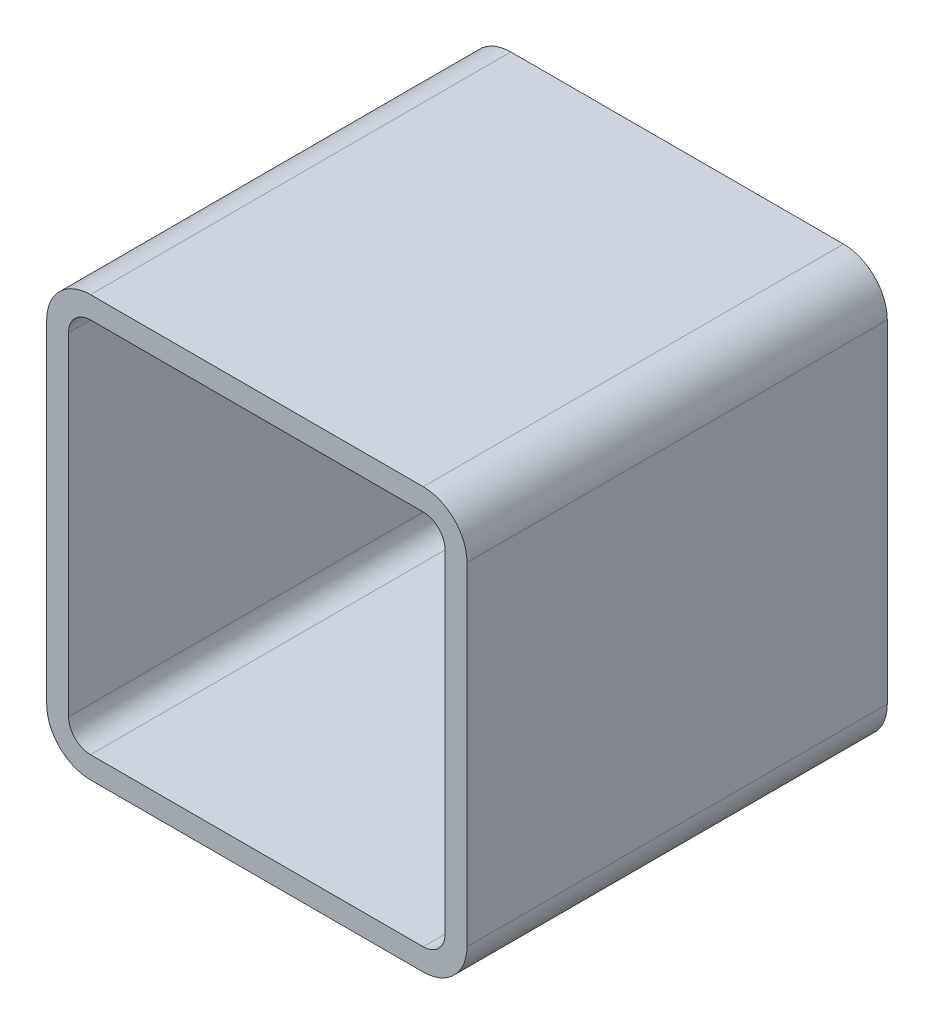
ISO-10303-21;
HEADER;
FILE_DESCRIPTION(('STEP AP214'),'2;1');
FILE_NAME('part.step','',(''),(''),'','','');
FILE_SCHEMA(('AUTOMOTIVE_DESIGN { 1 0 10303 214 1 1 1 1 }'));
ENDSEC;
DATA;
#1=APPLICATION_CONTEXT('core data for automotive mechanical design processes');
#2=APPLICATION_PROTOCOL_DEFINITION('international standard','automotive_design',2000,#1);
#3=PRODUCT_CONTEXT('',#1,'mechanical');
#4=PRODUCT('Part','Part','',(#3));
#5=PRODUCT_RELATED_PRODUCT_CATEGORY('part','',(#4));
#6=PRODUCT_DEFINITION_FORMATION('','',#4);
#7=PRODUCT_DEFINITION_CONTEXT('part definition',#1,'design');
#8=PRODUCT_DEFINITION('design','',#6,#7);
#9=PRODUCT_DEFINITION_SHAPE('','',#8);
#10=(LENGTH_UNIT() NAMED_UNIT(*) SI_UNIT(.MILLI.,.METRE.));
#11=(NAMED_UNIT(*) PLANE_ANGLE_UNIT() SI_UNIT($,.RADIAN.));
#12=(NAMED_UNIT(*) SI_UNIT($,.STERADIAN.) SOLID_ANGLE_UNIT());
#13=UNCERTAINTY_MEASURE_WITH_UNIT(LENGTH_MEASURE(1.E-05),#10,'distance_accuracy_value','');
#14=(GEOMETRIC_REPRESENTATION_CONTEXT(3) GLOBAL_UNCERTAINTY_ASSIGNED_CONTEXT((#13)) GLOBAL_UNIT_ASSIGNED_CONTEXT((#10,
#11,#12)) REPRESENTATION_CONTEXT('',''));
#15=CARTESIAN_POINT('',(0.,0.,0.));
#16=DIRECTION('',(0.,0.,1.));
#17=DIRECTION('',(1.,0.,0.));
#18=AXIS2_PLACEMENT_3D('',#15,#16,#17);
#19=CARTESIAN_POINT('',(32.8567030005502,274.924496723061,304.8));
#20=DIRECTION('',(0.,0.,1.));
#21=DIRECTION('',(1.,0.,0.));
#22=AXIS2_PLACEMENT_3D('',#19,#20,#21);
#23=PLANE('',#22);
#24=CARTESIAN_POINT('',(32.8567030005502,274.924496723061,304.8));
#25=DIRECTION('',(0.,0.,1.));
#26=DIRECTION('',(1.,0.,0.));
#27=AXIS2_PLACEMENT_3D('',#24,#25,#26);
#28=CIRCLE('',#27,31.75);
#29=CARTESIAN_POINT('',(32.8567030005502,306.674496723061,304.8));
#30=VERTEX_POINT('',#29);
#31=CARTESIAN_POINT('',(1.10670300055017,274.924496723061,304.8));
#32=VERTEX_POINT('',#31);
#33=EDGE_CURVE('E211',#30,#32,#28,.T.);
#34=ORIENTED_EDGE('',*,*,#33,.T.);
#35=DIRECTION('',(0.,-1.,0.));
#36=VECTOR('',#35,1.);
#37=CARTESIAN_POINT('',(1.10670300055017,33.6244967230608,304.8));
#38=LINE('',#37,#36);
#39=CARTESIAN_POINT('',(1.10670300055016,33.6244967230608,304.8));
#40=VERTEX_POINT('',#39);
#41=EDGE_CURVE('E214',#32,#40,#38,.T.);
#42=ORIENTED_EDGE('',*,*,#41,.T.);
#43=CARTESIAN_POINT('',(32.8567030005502,33.6244967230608,304.8));
#44=DIRECTION('',(0.,0.,1.));
#45=DIRECTION('',(1.,0.,0.));
#46=AXIS2_PLACEMENT_3D('',#43,#44,#45);
#47=CIRCLE('',#46,31.75);
#48=CARTESIAN_POINT('',(32.8567030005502,1.87449672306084,304.8));
#49=VERTEX_POINT('',#48);
#50=EDGE_CURVE('E217',#40,#49,#47,.T.);
#51=ORIENTED_EDGE('',*,*,#50,.T.);
#52=DIRECTION('',(1.,0.,0.));
#53=VECTOR('',#52,1.);
#54=CARTESIAN_POINT('',(274.15670300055,1.87449672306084,304.8));
#55=LINE('',#54,#53);
#56=CARTESIAN_POINT('',(274.15670300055,1.87449672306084,304.8));
#57=VERTEX_POINT('',#56);
#58=EDGE_CURVE('E219',#49,#57,#55,.T.);
#59=ORIENTED_EDGE('',*,*,#58,.T.);
#60=CARTESIAN_POINT('',(274.15670300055,33.6244967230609,304.8));
#61=DIRECTION('',(0.,0.,1.));
#62=DIRECTION('',(1.,0.,0.));
#63=AXIS2_PLACEMENT_3D('',#60,#61,#62);
#64=CIRCLE('',#63,31.75);
#65=CARTESIAN_POINT('',(305.90670300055,33.6244967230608,304.8));
#66=VERTEX_POINT('',#65);
#67=EDGE_CURVE('E221',#57,#66,#64,.T.);
#68=ORIENTED_EDGE('',*,*,#67,.T.);
#69=DIRECTION('',(0.,1.,0.));
#70=VECTOR('',#69,1.);
#71=CARTESIAN_POINT('',(305.90670300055,274.924496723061,304.8));
#72=LINE('',#71,#70);
#73=CARTESIAN_POINT('',(305.90670300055,274.924496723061,304.8));
#74=VERTEX_POINT('',#73);
#75=EDGE_CURVE('E223',#66,#74,#72,.T.);
#76=ORIENTED_EDGE('',*,*,#75,.T.);
#77=CARTESIAN_POINT('',(274.15670300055,274.924496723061,304.8));
#78=DIRECTION('',(0.,0.,1.));
#79=DIRECTION('',(1.,0.,0.));
#80=AXIS2_PLACEMENT_3D('',#77,#78,#79);
#81=CIRCLE('',#80,31.75);
#82=CARTESIAN_POINT('',(274.15670300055,306.674496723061,304.8));
#83=VERTEX_POINT('',#82);
#84=EDGE_CURVE('E225',#74,#83,#81,.T.);
#85=ORIENTED_EDGE('',*,*,#84,.T.);
#86=DIRECTION('',(-1.,0.,0.));
#87=VECTOR('',#86,1.);
#88=CARTESIAN_POINT('',(32.8567030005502,306.674496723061,304.8));
#89=LINE('',#88,#87);
#90=EDGE_CURVE('E227',#83,#30,#89,.T.);
#91=ORIENTED_EDGE('',*,*,#90,.T.);
#92=EDGE_LOOP('',(#34,#42,#51,#59,#68,#76,#85,#91));
#93=FACE_BOUND('',#92,.T.);
#94=DIRECTION('',(0.,-1.,0.));
#95=VECTOR('',#94,1.);
#96=CARTESIAN_POINT('',(16.9817030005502,33.6244967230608,304.8));
#97=LINE('',#96,#95);
#98=CARTESIAN_POINT('',(16.9817030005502,274.924496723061,304.8));
#99=VERTEX_POINT('',#98);
#100=CARTESIAN_POINT('',(16.9817030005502,33.6244967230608,304.8));
#101=VERTEX_POINT('',#100);
#102=EDGE_CURVE('E154',#99,#101,#97,.T.);
#103=ORIENTED_EDGE('',*,*,#102,.F.);
#104=CARTESIAN_POINT('',(32.8567030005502,274.924496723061,304.8));
#105=DIRECTION('',(0.,0.,1.));
#106=DIRECTION('',(1.,0.,0.));
#107=AXIS2_PLACEMENT_3D('',#104,#105,#106);
#108=CIRCLE('',#107,15.875);
#109=CARTESIAN_POINT('',(32.8567030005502,290.799496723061,304.8));
#110=VERTEX_POINT('',#109);
#111=EDGE_CURVE('E146',#110,#99,#108,.T.);
#112=ORIENTED_EDGE('',*,*,#111,.F.);
#113=DIRECTION('',(-1.,0.,0.));
#114=VECTOR('',#113,1.);
#115=CARTESIAN_POINT('',(32.8567030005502,290.799496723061,304.8));
#116=LINE('',#115,#114);
#117=CARTESIAN_POINT('',(274.15670300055,290.799496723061,304.8));
#118=VERTEX_POINT('',#117);
#119=EDGE_CURVE('E179',#118,#110,#116,.T.);
#120=ORIENTED_EDGE('',*,*,#119,.F.);
#121=CARTESIAN_POINT('',(274.15670300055,274.924496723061,304.8));
#122=DIRECTION('',(0.,0.,1.));
#123=DIRECTION('',(1.,0.,0.));
#124=AXIS2_PLACEMENT_3D('',#121,#122,#123);
#125=CIRCLE('',#124,15.875);
#126=CARTESIAN_POINT('',(290.03170300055,274.924496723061,304.8));
#127=VERTEX_POINT('',#126);
#128=EDGE_CURVE('E177',#127,#118,#125,.T.);
#129=ORIENTED_EDGE('',*,*,#128,.F.);
#130=DIRECTION('',(0.,1.,0.));
#131=VECTOR('',#130,1.);
#132=CARTESIAN_POINT('',(290.03170300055,274.924496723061,304.8));
#133=LINE('',#132,#131);
#134=CARTESIAN_POINT('',(290.03170300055,33.6244967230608,304.8));
#135=VERTEX_POINT('',#134);
#136=EDGE_CURVE('E175',#135,#127,#133,.T.);
#137=ORIENTED_EDGE('',*,*,#136,.F.);
#138=CARTESIAN_POINT('',(274.15670300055,33.6244967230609,304.8));
#139=DIRECTION('',(0.,0.,1.));
#140=DIRECTION('',(1.,0.,0.));
#141=AXIS2_PLACEMENT_3D('',#138,#139,#140);
#142=CIRCLE('',#141,15.875);
#143=CARTESIAN_POINT('',(274.15670300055,17.7494967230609,304.8));
#144=VERTEX_POINT('',#143);
#145=EDGE_CURVE('E173',#144,#135,#142,.T.);
#146=ORIENTED_EDGE('',*,*,#145,.F.);
#147=DIRECTION('',(1.,0.,0.));
#148=VECTOR('',#147,1.);
#149=CARTESIAN_POINT('',(274.15670300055,17.7494967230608,304.8));
#150=LINE('',#149,#148);
#151=CARTESIAN_POINT('',(32.8567030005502,17.7494967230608,304.8));
#152=VERTEX_POINT('',#151);
#153=EDGE_CURVE('E169',#152,#144,#150,.T.);
#154=ORIENTED_EDGE('',*,*,#153,.F.);
#155=CARTESIAN_POINT('',(32.8567030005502,33.6244967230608,304.8));
#156=DIRECTION('',(0.,0.,1.));
#157=DIRECTION('',(1.,0.,0.));
#158=AXIS2_PLACEMENT_3D('',#155,#156,#157);
#159=CIRCLE('',#158,15.875);
#160=EDGE_CURVE('E167',#101,#152,#159,.T.);
#161=ORIENTED_EDGE('',*,*,#160,.F.);
#162=EDGE_LOOP('',(#103,#112,#120,#129,#137,#146,#154,#161));
#163=FACE_BOUND('',#162,.T.);
#164=ADVANCED_FACE('F33',(#93,#163),#23,.T.);
#165=CARTESIAN_POINT('',(32.8567030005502,274.924496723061,0.));
#166=DIRECTION('',(0.,0.,1.));
#167=DIRECTION('',(1.,0.,0.));
#168=AXIS2_PLACEMENT_3D('',#165,#166,#167);
#169=PLANE('',#168);
#170=CARTESIAN_POINT('',(32.8567030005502,274.924496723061,0.));
#171=DIRECTION('',(0.,0.,1.));
#172=DIRECTION('',(1.,0.,0.));
#173=AXIS2_PLACEMENT_3D('',#170,#171,#172);
#174=CIRCLE('',#173,31.75);
#175=CARTESIAN_POINT('',(32.8567030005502,306.674496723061,0.));
#176=VERTEX_POINT('',#175);
#177=CARTESIAN_POINT('',(1.10670300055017,274.924496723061,0.));
#178=VERTEX_POINT('',#177);
#179=EDGE_CURVE('E162',#176,#178,#174,.T.);
#180=ORIENTED_EDGE('',*,*,#179,.F.);
#181=DIRECTION('',(-1.,0.,0.));
#182=VECTOR('',#181,1.);
#183=CARTESIAN_POINT('',(32.8567030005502,306.674496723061,0.));
#184=LINE('',#183,#182);
#185=CARTESIAN_POINT('',(274.15670300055,306.674496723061,0.));
#186=VERTEX_POINT('',#185);
#187=EDGE_CURVE('E215',#186,#176,#184,.T.);
#188=ORIENTED_EDGE('',*,*,#187,.F.);
#189=CARTESIAN_POINT('',(274.15670300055,274.924496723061,0.));
#190=DIRECTION('',(0.,0.,1.));
#191=DIRECTION('',(1.,0.,0.));
#192=AXIS2_PLACEMENT_3D('',#189,#190,#191);
#193=CIRCLE('',#192,31.75);
#194=CARTESIAN_POINT('',(305.90670300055,274.924496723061,0.));
#195=VERTEX_POINT('',#194);
#196=EDGE_CURVE('E242',#195,#186,#193,.T.);
#197=ORIENTED_EDGE('',*,*,#196,.F.);
#198=DIRECTION('',(0.,1.,0.));
#199=VECTOR('',#198,1.);
#200=CARTESIAN_POINT('',(305.90670300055,274.924496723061,0.));
#201=LINE('',#200,#199);
#202=CARTESIAN_POINT('',(305.90670300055,33.6244967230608,0.));
#203=VERTEX_POINT('',#202);
#204=EDGE_CURVE('E240',#203,#195,#201,.T.);
#205=ORIENTED_EDGE('',*,*,#204,.F.);
#206=CARTESIAN_POINT('',(274.15670300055,33.6244967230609,0.));
#207=DIRECTION('',(0.,0.,1.));
#208=DIRECTION('',(1.,0.,0.));
#209=AXIS2_PLACEMENT_3D('',#206,#207,#208);
#210=CIRCLE('',#209,31.75);
#211=CARTESIAN_POINT('',(274.15670300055,1.87449672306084,0.));
#212=VERTEX_POINT('',#211);
#213=EDGE_CURVE('E238',#212,#203,#210,.T.);
#214=ORIENTED_EDGE('',*,*,#213,.F.);
#215=DIRECTION('',(1.,0.,0.));
#216=VECTOR('',#215,1.);
#217=CARTESIAN_POINT('',(274.15670300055,1.87449672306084,0.));
#218=LINE('',#217,#216);
#219=CARTESIAN_POINT('',(32.8567030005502,1.87449672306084,0.));
#220=VERTEX_POINT('',#219);
#221=EDGE_CURVE('E236',#220,#212,#218,.T.);
#222=ORIENTED_EDGE('',*,*,#221,.F.);
#223=CARTESIAN_POINT('',(32.8567030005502,33.6244967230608,0.));
#224=DIRECTION('',(0.,0.,1.));
#225=DIRECTION('',(1.,0.,0.));
#226=AXIS2_PLACEMENT_3D('',#223,#224,#225);
#227=CIRCLE('',#226,31.75);
#228=CARTESIAN_POINT('',(1.10670300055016,33.6244967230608,0.));
#229=VERTEX_POINT('',#228);
#230=EDGE_CURVE('E234',#229,#220,#227,.T.);
#231=ORIENTED_EDGE('',*,*,#230,.F.);
#232=DIRECTION('',(0.,-1.,0.));
#233=VECTOR('',#232,1.);
#234=CARTESIAN_POINT('',(1.10670300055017,33.6244967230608,0.));
#235=LINE('',#234,#233);
#236=EDGE_CURVE('E232',#178,#229,#235,.T.);
#237=ORIENTED_EDGE('',*,*,#236,.F.);
#238=EDGE_LOOP('',(#180,#188,#197,#205,#214,#222,#231,#237));
#239=FACE_BOUND('',#238,.T.);
#240=CARTESIAN_POINT('',(32.8567030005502,274.924496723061,0.));
#241=DIRECTION('',(0.,0.,1.));
#242=DIRECTION('',(1.,0.,0.));
#243=AXIS2_PLACEMENT_3D('',#240,#241,#242);
#244=CIRCLE('',#243,15.875);
#245=CARTESIAN_POINT('',(32.8567030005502,290.799496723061,0.));
#246=VERTEX_POINT('',#245);
#247=CARTESIAN_POINT('',(16.9817030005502,274.924496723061,0.));
#248=VERTEX_POINT('',#247);
#249=EDGE_CURVE('E56',#246,#248,#244,.T.);
#250=ORIENTED_EDGE('',*,*,#249,.T.);
#251=DIRECTION('',(0.,-1.,0.));
#252=VECTOR('',#251,1.);
#253=CARTESIAN_POINT('',(16.9817030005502,33.6244967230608,0.));
#254=LINE('',#253,#252);
#255=CARTESIAN_POINT('',(16.9817030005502,33.6244967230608,0.));
#256=VERTEX_POINT('',#255);
#257=EDGE_CURVE('E161',#248,#256,#254,.T.);
#258=ORIENTED_EDGE('',*,*,#257,.T.);
#259=CARTESIAN_POINT('',(32.8567030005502,33.6244967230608,0.));
#260=DIRECTION('',(0.,0.,1.));
#261=DIRECTION('',(1.,0.,0.));
#262=AXIS2_PLACEMENT_3D('',#259,#260,#261);
#263=CIRCLE('',#262,15.875);
#264=CARTESIAN_POINT('',(32.8567030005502,17.7494967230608,0.));
#265=VERTEX_POINT('',#264);
#266=EDGE_CURVE('E183',#256,#265,#263,.T.);
#267=ORIENTED_EDGE('',*,*,#266,.T.);
#268=DIRECTION('',(1.,0.,0.));
#269=VECTOR('',#268,1.);
#270=CARTESIAN_POINT('',(274.15670300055,17.7494967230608,0.));
#271=LINE('',#270,#269);
#272=CARTESIAN_POINT('',(274.15670300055,17.7494967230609,0.));
#273=VERTEX_POINT('',#272);
#274=EDGE_CURVE('E186',#265,#273,#271,.T.);
#275=ORIENTED_EDGE('',*,*,#274,.T.);
#276=CARTESIAN_POINT('',(274.15670300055,33.6244967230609,0.));
#277=DIRECTION('',(0.,0.,1.));
#278=DIRECTION('',(1.,0.,0.));
#279=AXIS2_PLACEMENT_3D('',#276,#277,#278);
#280=CIRCLE('',#279,15.875);
#281=CARTESIAN_POINT('',(290.03170300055,33.6244967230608,0.));
#282=VERTEX_POINT('',#281);
#283=EDGE_CURVE('E189',#273,#282,#280,.T.);
#284=ORIENTED_EDGE('',*,*,#283,.T.);
#285=DIRECTION('',(0.,1.,0.));
#286=VECTOR('',#285,1.);
#287=CARTESIAN_POINT('',(290.03170300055,274.924496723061,0.));
#288=LINE('',#287,#286);
#289=CARTESIAN_POINT('',(290.03170300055,274.924496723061,0.));
#290=VERTEX_POINT('',#289);
#291=EDGE_CURVE('E192',#282,#290,#288,.T.);
#292=ORIENTED_EDGE('',*,*,#291,.T.);
#293=CARTESIAN_POINT('',(274.15670300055,274.924496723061,0.));
#294=DIRECTION('',(0.,0.,1.));
#295=DIRECTION('',(1.,0.,0.));
#296=AXIS2_PLACEMENT_3D('',#293,#294,#295);
#297=CIRCLE('',#296,15.875);
#298=CARTESIAN_POINT('',(274.15670300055,290.799496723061,0.));
#299=VERTEX_POINT('',#298);
#300=EDGE_CURVE('E195',#290,#299,#297,.T.);
#301=ORIENTED_EDGE('',*,*,#300,.T.);
#302=DIRECTION('',(-1.,0.,0.));
#303=VECTOR('',#302,1.);
#304=CARTESIAN_POINT('',(32.8567030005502,290.799496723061,0.));
#305=LINE('',#304,#303);
#306=EDGE_CURVE('E155',#299,#246,#305,.T.);
#307=ORIENTED_EDGE('',*,*,#306,.T.);
#308=EDGE_LOOP('',(#250,#258,#267,#275,#284,#292,#301,#307));
#309=FACE_BOUND('',#308,.T.);
#310=ADVANCED_FACE('F272',(#239,#309),#169,.F.);
#311=CARTESIAN_POINT('',(32.8567030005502,274.924496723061,304.8));
#312=DIRECTION('',(0.,0.,-1.));
#313=DIRECTION('',(-1.,0.,0.));
#314=AXIS2_PLACEMENT_3D('',#311,#312,#313);
#315=CYLINDRICAL_SURFACE('',#314,31.75);
#316=ORIENTED_EDGE('',*,*,#179,.T.);
#317=DIRECTION('',(0.,0.,-1.));
#318=VECTOR('',#317,1.);
#319=CARTESIAN_POINT('',(1.10670300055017,274.924496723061,304.8));
#320=LINE('',#319,#318);
#321=EDGE_CURVE('E11',#32,#178,#320,.T.);
#322=ORIENTED_EDGE('',*,*,#321,.F.);
#323=ORIENTED_EDGE('',*,*,#33,.F.);
#324=DIRECTION('',(0.,0.,-1.));
#325=VECTOR('',#324,1.);
#326=CARTESIAN_POINT('',(32.8567030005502,306.674496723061,304.8));
#327=LINE('',#326,#325);
#328=EDGE_CURVE('E229',#30,#176,#327,.T.);
#329=ORIENTED_EDGE('',*,*,#328,.T.);
#330=EDGE_LOOP('',(#316,#322,#323,#329));
#331=FACE_BOUND('',#330,.T.);
#332=ADVANCED_FACE('F35',(#331),#315,.T.);
#333=CARTESIAN_POINT('',(1.10670300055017,33.6244967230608,304.8));
#334=DIRECTION('',(1.,0.,0.));
#335=DIRECTION('',(0.,0.,-1.));
#336=AXIS2_PLACEMENT_3D('',#333,#334,#335);
#337=PLANE('',#336);
#338=ORIENTED_EDGE('',*,*,#236,.T.);
#339=DIRECTION('',(0.,0.,-1.));
#340=VECTOR('',#339,1.);
#341=CARTESIAN_POINT('',(1.10670300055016,33.6244967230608,304.8));
#342=LINE('',#341,#340);
#343=EDGE_CURVE('E41',#40,#229,#342,.T.);
#344=ORIENTED_EDGE('',*,*,#343,.F.);
#345=ORIENTED_EDGE('',*,*,#41,.F.);
#346=ORIENTED_EDGE('',*,*,#321,.T.);
#347=EDGE_LOOP('',(#338,#344,#345,#346));
#348=FACE_BOUND('',#347,.T.);
#349=ADVANCED_FACE('F289',(#348),#337,.F.);
#350=CARTESIAN_POINT('',(32.8567030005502,33.6244967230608,304.8));
#351=DIRECTION('',(0.,0.,-1.));
#352=DIRECTION('',(-1.,0.,0.));
#353=AXIS2_PLACEMENT_3D('',#350,#351,#352);
#354=CYLINDRICAL_SURFACE('',#353,31.75);
#355=ORIENTED_EDGE('',*,*,#230,.T.);
#356=DIRECTION('',(0.,0.,-1.));
#357=VECTOR('',#356,1.);
#358=CARTESIAN_POINT('',(32.8567030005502,1.87449672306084,304.8));
#359=LINE('',#358,#357);
#360=EDGE_CURVE('E259',#49,#220,#359,.T.);
#361=ORIENTED_EDGE('',*,*,#360,.F.);
#362=ORIENTED_EDGE('',*,*,#50,.F.);
#363=ORIENTED_EDGE('',*,*,#343,.T.);
#364=EDGE_LOOP('',(#355,#361,#362,#363));
#365=FACE_BOUND('',#364,.T.);
#366=ADVANCED_FACE('F266',(#365),#354,.T.);
#367=CARTESIAN_POINT('',(274.15670300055,1.87449672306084,304.8));
#368=DIRECTION('',(0.,1.,0.));
#369=DIRECTION('',(0.,0.,1.));
#370=AXIS2_PLACEMENT_3D('',#367,#368,#369);
#371=PLANE('',#370);
#372=ORIENTED_EDGE('',*,*,#221,.T.);
#373=DIRECTION('',(0.,0.,-1.));
#374=VECTOR('',#373,1.);
#375=CARTESIAN_POINT('',(274.15670300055,1.87449672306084,304.8));
#376=LINE('',#375,#374);
#377=EDGE_CURVE('E256',#57,#212,#376,.T.);
#378=ORIENTED_EDGE('',*,*,#377,.F.);
#379=ORIENTED_EDGE('',*,*,#58,.F.);
#380=ORIENTED_EDGE('',*,*,#360,.T.);
#381=EDGE_LOOP('',(#372,#378,#379,#380));
#382=FACE_BOUND('',#381,.T.);
#383=ADVANCED_FACE('F278',(#382),#371,.F.);
#384=CARTESIAN_POINT('',(274.15670300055,33.6244967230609,304.8));
#385=DIRECTION('',(0.,0.,-1.));
#386=DIRECTION('',(-1.,0.,0.));
#387=AXIS2_PLACEMENT_3D('',#384,#385,#386);
#388=CYLINDRICAL_SURFACE('',#387,31.75);
#389=ORIENTED_EDGE('',*,*,#213,.T.);
#390=DIRECTION('',(0.,0.,-1.));
#391=VECTOR('',#390,1.);
#392=CARTESIAN_POINT('',(305.90670300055,33.6244967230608,304.8));
#393=LINE('',#392,#391);
#394=EDGE_CURVE('E253',#66,#203,#393,.T.);
#395=ORIENTED_EDGE('',*,*,#394,.F.);
#396=ORIENTED_EDGE('',*,*,#67,.F.);
#397=ORIENTED_EDGE('',*,*,#377,.T.);
#398=EDGE_LOOP('',(#389,#395,#396,#397));
#399=FACE_BOUND('',#398,.T.);
#400=ADVANCED_FACE('F282',(#399),#388,.T.);
#401=CARTESIAN_POINT('',(305.90670300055,274.924496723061,304.8));
#402=DIRECTION('',(-1.,0.,0.));
#403=DIRECTION('',(0.,0.,1.));
#404=AXIS2_PLACEMENT_3D('',#401,#402,#403);
#405=PLANE('',#404);
#406=ORIENTED_EDGE('',*,*,#204,.T.);
#407=DIRECTION('',(0.,0.,-1.));
#408=VECTOR('',#407,1.);
#409=CARTESIAN_POINT('',(305.90670300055,274.924496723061,304.8));
#410=LINE('',#409,#408);
#411=EDGE_CURVE('E250',#74,#195,#410,.T.);
#412=ORIENTED_EDGE('',*,*,#411,.F.);
#413=ORIENTED_EDGE('',*,*,#75,.F.);
#414=ORIENTED_EDGE('',*,*,#394,.T.);
#415=EDGE_LOOP('',(#406,#412,#413,#414));
#416=FACE_BOUND('',#415,.T.);
#417=ADVANCED_FACE('F302',(#416),#405,.F.);
#418=CARTESIAN_POINT('',(274.15670300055,274.924496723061,304.8));
#419=DIRECTION('',(0.,0.,-1.));
#420=DIRECTION('',(-1.,0.,0.));
#421=AXIS2_PLACEMENT_3D('',#418,#419,#420);
#422=CYLINDRICAL_SURFACE('',#421,31.75);
#423=ORIENTED_EDGE('',*,*,#196,.T.);
#424=DIRECTION('',(0.,0.,-1.));
#425=VECTOR('',#424,1.);
#426=CARTESIAN_POINT('',(274.15670300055,306.674496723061,304.8));
#427=LINE('',#426,#425);
#428=EDGE_CURVE('E247',#83,#186,#427,.T.);
#429=ORIENTED_EDGE('',*,*,#428,.F.);
#430=ORIENTED_EDGE('',*,*,#84,.F.);
#431=ORIENTED_EDGE('',*,*,#411,.T.);
#432=EDGE_LOOP('',(#423,#429,#430,#431));
#433=FACE_BOUND('',#432,.T.);
#434=ADVANCED_FACE('F300',(#433),#422,.T.);
#435=CARTESIAN_POINT('',(32.8567030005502,306.674496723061,304.8));
#436=DIRECTION('',(0.,-1.,0.));
#437=DIRECTION('',(0.,0.,-1.));
#438=AXIS2_PLACEMENT_3D('',#435,#436,#437);
#439=PLANE('',#438);
#440=ORIENTED_EDGE('',*,*,#187,.T.);
#441=ORIENTED_EDGE('',*,*,#328,.F.);
#442=ORIENTED_EDGE('',*,*,#90,.F.);
#443=ORIENTED_EDGE('',*,*,#428,.T.);
#444=EDGE_LOOP('',(#440,#441,#442,#443));
#445=FACE_BOUND('',#444,.T.);
#446=ADVANCED_FACE('F295',(#445),#439,.F.);
#447=CARTESIAN_POINT('',(32.8567030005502,274.924496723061,304.8));
#448=DIRECTION('',(0.,0.,-1.));
#449=DIRECTION('',(-1.,0.,0.));
#450=AXIS2_PLACEMENT_3D('',#447,#448,#449);
#451=CYLINDRICAL_SURFACE('',#450,15.875);
#452=ORIENTED_EDGE('',*,*,#249,.F.);
#453=DIRECTION('',(0.,0.,-1.));
#454=VECTOR('',#453,1.);
#455=CARTESIAN_POINT('',(32.8567030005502,290.799496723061,304.8));
#456=LINE('',#455,#454);
#457=EDGE_CURVE('E150',#110,#246,#456,.T.);
#458=ORIENTED_EDGE('',*,*,#457,.F.);
#459=ORIENTED_EDGE('',*,*,#111,.T.);
#460=DIRECTION('',(0.,0.,-1.));
#461=VECTOR('',#460,1.);
#462=CARTESIAN_POINT('',(16.9817030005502,274.924496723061,304.8));
#463=LINE('',#462,#461);
#464=EDGE_CURVE('E149',#99,#248,#463,.T.);
#465=ORIENTED_EDGE('',*,*,#464,.T.);
#466=EDGE_LOOP('',(#452,#458,#459,#465));
#467=FACE_BOUND('',#466,.T.);
#468=ADVANCED_FACE('F148',(#467),#451,.F.);
#469=CARTESIAN_POINT('',(16.9817030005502,33.6244967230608,304.8));
#470=DIRECTION('',(1.,0.,0.));
#471=DIRECTION('',(0.,0.,-1.));
#472=AXIS2_PLACEMENT_3D('',#469,#470,#471);
#473=PLANE('',#472);
#474=ORIENTED_EDGE('',*,*,#257,.F.);
#475=ORIENTED_EDGE('',*,*,#464,.F.);
#476=ORIENTED_EDGE('',*,*,#102,.T.);
#477=DIRECTION('',(0.,0.,-1.));
#478=VECTOR('',#477,1.);
#479=CARTESIAN_POINT('',(16.9817030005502,33.6244967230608,304.8));
#480=LINE('',#479,#478);
#481=EDGE_CURVE('E163',#101,#256,#480,.T.);
#482=ORIENTED_EDGE('',*,*,#481,.T.);
#483=EDGE_LOOP('',(#474,#475,#476,#482));
#484=FACE_BOUND('',#483,.T.);
#485=ADVANCED_FACE('F158',(#484),#473,.T.);
#486=CARTESIAN_POINT('',(32.8567030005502,33.6244967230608,304.8));
#487=DIRECTION('',(0.,0.,-1.));
#488=DIRECTION('',(-1.,0.,0.));
#489=AXIS2_PLACEMENT_3D('',#486,#487,#488);
#490=CYLINDRICAL_SURFACE('',#489,15.875);
#491=ORIENTED_EDGE('',*,*,#266,.F.);
#492=ORIENTED_EDGE('',*,*,#481,.F.);
#493=ORIENTED_EDGE('',*,*,#160,.T.);
#494=DIRECTION('',(0.,0.,-1.));
#495=VECTOR('',#494,1.);
#496=CARTESIAN_POINT('',(32.8567030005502,17.7494967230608,304.8));
#497=LINE('',#496,#495);
#498=EDGE_CURVE('E208',#152,#265,#497,.T.);
#499=ORIENTED_EDGE('',*,*,#498,.T.);
#500=EDGE_LOOP('',(#491,#492,#493,#499));
#501=FACE_BOUND('',#500,.T.);
#502=ADVANCED_FACE('F327',(#501),#490,.F.);
#503=CARTESIAN_POINT('',(274.15670300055,17.7494967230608,304.8));
#504=DIRECTION('',(0.,1.,0.));
#505=DIRECTION('',(0.,0.,1.));
#506=AXIS2_PLACEMENT_3D('',#503,#504,#505);
#507=PLANE('',#506);
#508=ORIENTED_EDGE('',*,*,#274,.F.);
#509=ORIENTED_EDGE('',*,*,#498,.F.);
#510=ORIENTED_EDGE('',*,*,#153,.T.);
#511=DIRECTION('',(0.,0.,-1.));
#512=VECTOR('',#511,1.);
#513=CARTESIAN_POINT('',(274.15670300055,17.7494967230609,304.8));
#514=LINE('',#513,#512);
#515=EDGE_CURVE('E206',#144,#273,#514,.T.);
#516=ORIENTED_EDGE('',*,*,#515,.T.);
#517=EDGE_LOOP('',(#508,#509,#510,#516));
#518=FACE_BOUND('',#517,.T.);
#519=ADVANCED_FACE('F331',(#518),#507,.T.);
#520=CARTESIAN_POINT('',(274.15670300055,33.6244967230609,304.8));
#521=DIRECTION('',(0.,0.,-1.));
#522=DIRECTION('',(-1.,0.,0.));
#523=AXIS2_PLACEMENT_3D('',#520,#521,#522);
#524=CYLINDRICAL_SURFACE('',#523,15.875);
#525=ORIENTED_EDGE('',*,*,#283,.F.);
#526=ORIENTED_EDGE('',*,*,#515,.F.);
#527=ORIENTED_EDGE('',*,*,#145,.T.);
#528=DIRECTION('',(0.,0.,-1.));
#529=VECTOR('',#528,1.);
#530=CARTESIAN_POINT('',(290.03170300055,33.6244967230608,304.8));
#531=LINE('',#530,#529);
#532=EDGE_CURVE('E204',#135,#282,#531,.T.);
#533=ORIENTED_EDGE('',*,*,#532,.T.);
#534=EDGE_LOOP('',(#525,#526,#527,#533));
#535=FACE_BOUND('',#534,.T.);
#536=ADVANCED_FACE('F337',(#535),#524,.F.);
#537=CARTESIAN_POINT('',(290.03170300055,274.924496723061,304.8));
#538=DIRECTION('',(-1.,0.,0.));
#539=DIRECTION('',(0.,0.,1.));
#540=AXIS2_PLACEMENT_3D('',#537,#538,#539);
#541=PLANE('',#540);
#542=ORIENTED_EDGE('',*,*,#291,.F.);
#543=ORIENTED_EDGE('',*,*,#532,.F.);
#544=ORIENTED_EDGE('',*,*,#136,.T.);
#545=DIRECTION('',(0.,0.,-1.));
#546=VECTOR('',#545,1.);
#547=CARTESIAN_POINT('',(290.03170300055,274.924496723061,304.8));
#548=LINE('',#547,#546);
#549=EDGE_CURVE('E202',#127,#290,#548,.T.);
#550=ORIENTED_EDGE('',*,*,#549,.T.);
#551=EDGE_LOOP('',(#542,#543,#544,#550));
#552=FACE_BOUND('',#551,.T.);
#553=ADVANCED_FACE('F341',(#552),#541,.T.);
#554=CARTESIAN_POINT('',(274.15670300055,274.924496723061,304.8));
#555=DIRECTION('',(0.,0.,-1.));
#556=DIRECTION('',(-1.,0.,0.));
#557=AXIS2_PLACEMENT_3D('',#554,#555,#556);
#558=CYLINDRICAL_SURFACE('',#557,15.875);
#559=ORIENTED_EDGE('',*,*,#300,.F.);
#560=ORIENTED_EDGE('',*,*,#549,.F.);
#561=ORIENTED_EDGE('',*,*,#128,.T.);
#562=DIRECTION('',(0.,0.,-1.));
#563=VECTOR('',#562,1.);
#564=CARTESIAN_POINT('',(274.15670300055,290.799496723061,304.8));
#565=LINE('',#564,#563);
#566=EDGE_CURVE('E48',#118,#299,#565,.T.);
#567=ORIENTED_EDGE('',*,*,#566,.T.);
#568=EDGE_LOOP('',(#559,#560,#561,#567));
#569=FACE_BOUND('',#568,.T.);
#570=ADVANCED_FACE('F345',(#569),#558,.F.);
#571=CARTESIAN_POINT('',(32.8567030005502,290.799496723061,304.8));
#572=DIRECTION('',(0.,-1.,0.));
#573=DIRECTION('',(0.,0.,-1.));
#574=AXIS2_PLACEMENT_3D('',#571,#572,#573);
#575=PLANE('',#574);
#576=ORIENTED_EDGE('',*,*,#306,.F.);
#577=ORIENTED_EDGE('',*,*,#566,.F.);
#578=ORIENTED_EDGE('',*,*,#119,.T.);
#579=ORIENTED_EDGE('',*,*,#457,.T.);
#580=EDGE_LOOP('',(#576,#577,#578,#579));
#581=FACE_BOUND('',#580,.T.);
#582=ADVANCED_FACE('F349',(#581),#575,.T.);
#583=CLOSED_SHELL('',(#164,#310,#332,#349,#366,#383,#400,#417,#434,#446,#468,#485,#502,#519,
#536,#553,#570,#582));
#584=MANIFOLD_SOLID_BREP('B2',#583);
#585=ADVANCED_BREP_SHAPE_REPRESENTATION('',(#18,#584),#14);
#586=SHAPE_DEFINITION_REPRESENTATION(#9,#585);
ENDSEC;
END-ISO-10303-21;
